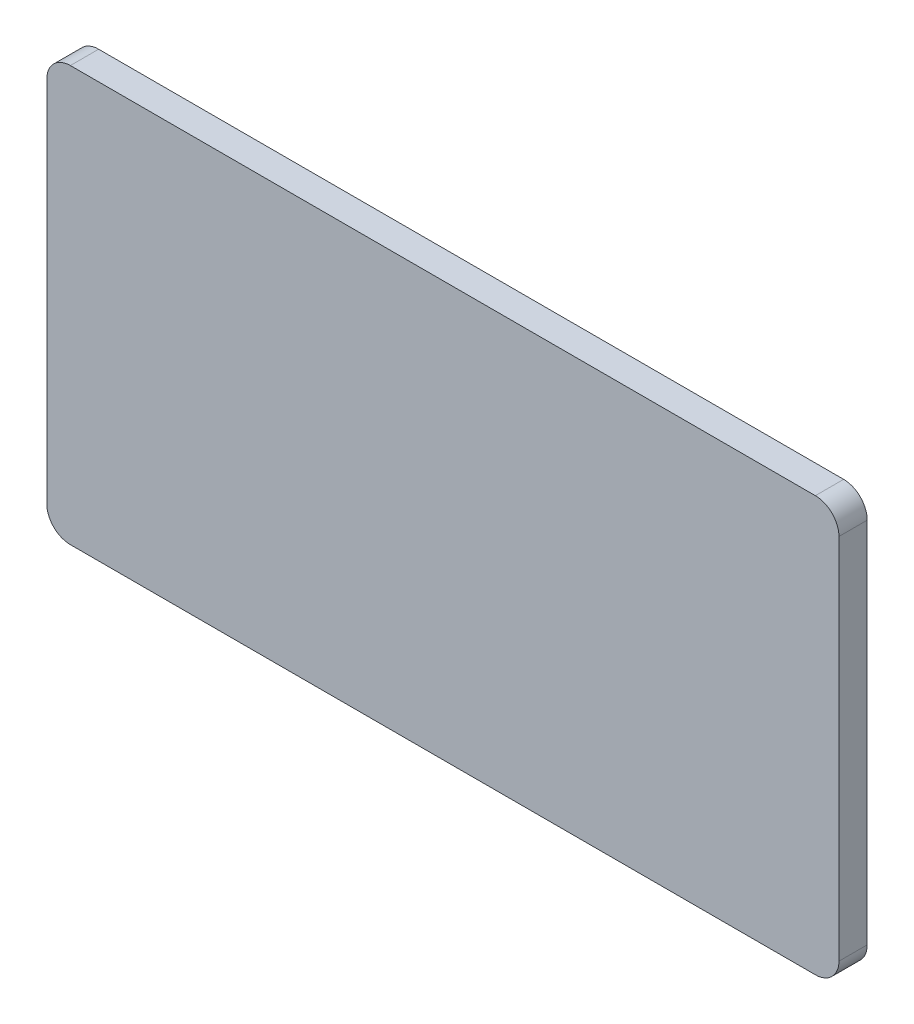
from build123d import *

# Parameters (mm, degrees)
BOSS_EXTRU_1_DEPTH = 3
BOSS_EXTRU_2_DEPTH = 3


with BuildPart() as part:
    # Esquisse1 → Boss.-Extru.1 (new body)
    with BuildSketch(Plane.XY):
        with BuildLine():
            Line((-39.5, 107), (39.5, 107))
            ThreePointArc((39.5, 107), (41.267766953, 106.267766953), (42, 104.5))
            Line((42, 104.5), (42, 65.5))
            ThreePointArc((42, 65.5), (41.267766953, 63.732233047), (39.5, 63))
            Line((39.5, 63), (-39.5, 63))
            ThreePointArc((-39.5, 63), (-41.267766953, 63.732233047), (-42, 65.5))
            Line((-42, 65.5), (-42, 104.5))
            ThreePointArc((-42, 104.5), (-41.267766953, 106.267766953), (-39.5, 107))
        make_face()
    extrude(amount=BOSS_EXTRU_1_DEPTH)

    # Esquisse2 → Boss.-Extru.2 (add)
    with BuildSketch(Plane(origin=(0, 0, 0), x_dir=(-1, 0, 0), z_dir=(0, 0, -1))):
        with BuildLine():
            Line((-33.9, 100.4), (33.9, 100.4))
            ThreePointArc((33.9, 100.4), (35.667766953, 99.667766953), (36.4, 97.9))
            Line((36.4, 97.9), (36.4, 76.9))
            ThreePointArc((36.4, 76.9), (35.667766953, 75.132233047), (33.9, 74.4))
            Line((33.9, 74.4), (-33.9, 74.4))
            ThreePointArc((-33.9, 74.4), (-35.667766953, 75.132233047), (-36.4, 76.9))
            Line((-36.4, 76.9), (-36.4, 97.9))
            ThreePointArc((-36.4, 97.9), (-35.667766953, 99.667766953), (-33.9, 100.4))
        make_face()
    extrude(amount=BOSS_EXTRU_2_DEPTH)


solid = part.part
